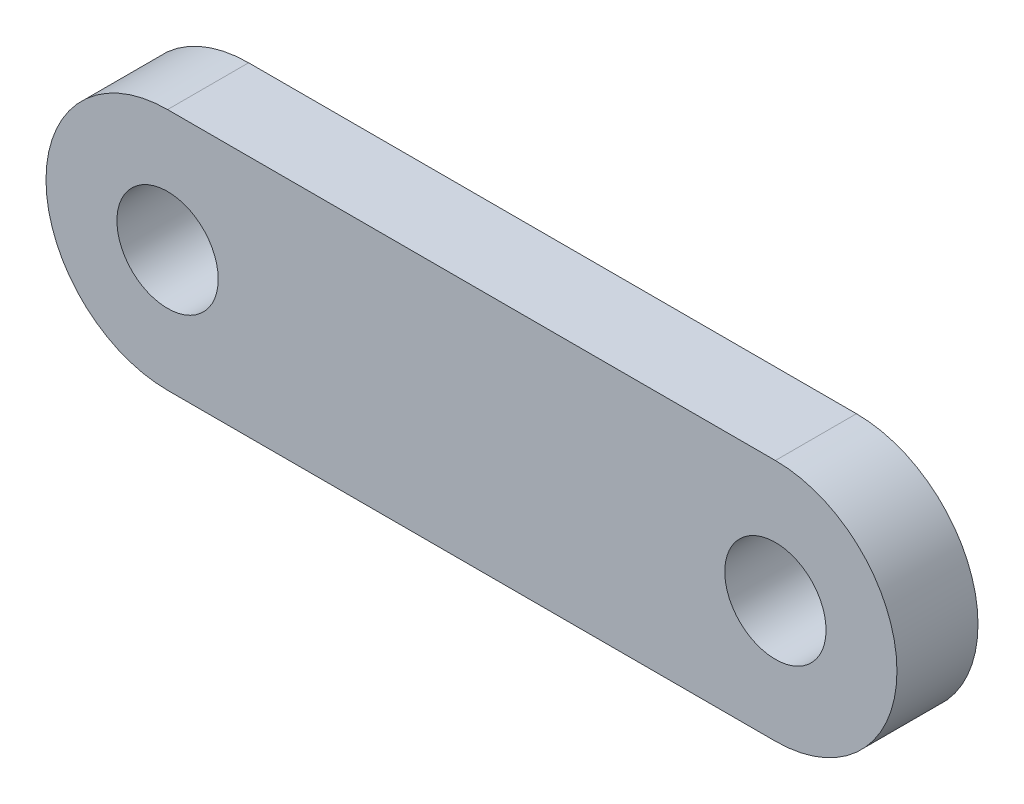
from build123d import *

# Parameters (mm, degrees)
SKETCH_1_R      = 2.5
EXTRUDE_1_DEPTH = 4


with BuildPart() as part:
    # Sketch 1 → Extrude 1 (new body)
    with BuildSketch(Plane.XY):
        with BuildLine():
            Line((-15, 6), (15, 6))
            ThreePointArc((15, 6), (21, 0), (15, -6))
            Line((15, -6), (-15, -6))
            ThreePointArc((-15, -6), (-21, 0), (-15, 6))
        make_face()
        with Locations((-15, 0)):
            Circle(SKETCH_1_R, mode=Mode.SUBTRACT)
        with Locations((15, 0)):
            Circle(SKETCH_1_R, mode=Mode.SUBTRACT)
    extrude(amount=EXTRUDE_1_DEPTH)


solid = part.part
